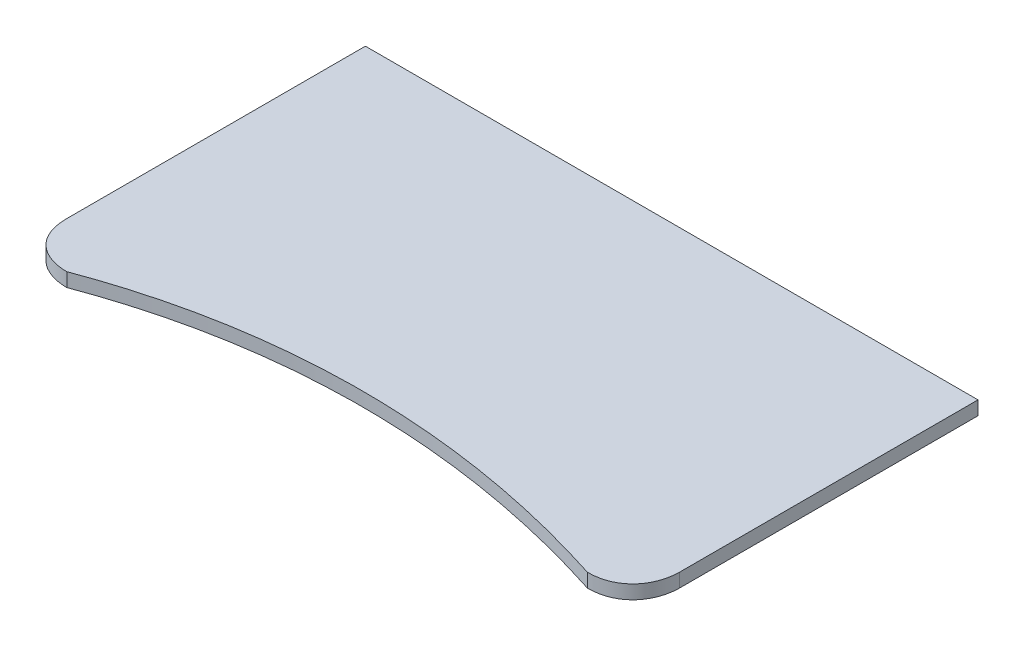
ISO-10303-21;
HEADER;
FILE_DESCRIPTION(('STEP AP214'),'2;1');
FILE_NAME('part.step','',(''),(''),'','','');
FILE_SCHEMA(('AUTOMOTIVE_DESIGN { 1 0 10303 214 1 1 1 1 }'));
ENDSEC;
DATA;
#1=APPLICATION_CONTEXT('core data for automotive mechanical design processes');
#2=APPLICATION_PROTOCOL_DEFINITION('international standard','automotive_design',2000,#1);
#3=PRODUCT_CONTEXT('',#1,'mechanical');
#4=PRODUCT('Part','Part','',(#3));
#5=PRODUCT_RELATED_PRODUCT_CATEGORY('part','',(#4));
#6=PRODUCT_DEFINITION_FORMATION('','',#4);
#7=PRODUCT_DEFINITION_CONTEXT('part definition',#1,'design');
#8=PRODUCT_DEFINITION('design','',#6,#7);
#9=PRODUCT_DEFINITION_SHAPE('','',#8);
#10=(LENGTH_UNIT() NAMED_UNIT(*) SI_UNIT(.MILLI.,.METRE.));
#11=(NAMED_UNIT(*) PLANE_ANGLE_UNIT() SI_UNIT($,.RADIAN.));
#12=(NAMED_UNIT(*) SI_UNIT($,.STERADIAN.) SOLID_ANGLE_UNIT());
#13=UNCERTAINTY_MEASURE_WITH_UNIT(LENGTH_MEASURE(1.E-05),#10,'distance_accuracy_value','');
#14=(GEOMETRIC_REPRESENTATION_CONTEXT(3) GLOBAL_UNCERTAINTY_ASSIGNED_CONTEXT((#13)) GLOBAL_UNIT_ASSIGNED_CONTEXT((#10,
#11,#12)) REPRESENTATION_CONTEXT('',''));
#15=CARTESIAN_POINT('',(0.,0.,0.));
#16=DIRECTION('',(0.,0.,1.));
#17=DIRECTION('',(1.,0.,0.));
#18=AXIS2_PLACEMENT_3D('',#15,#16,#17);
#19=CARTESIAN_POINT('',(-400.,18.,225.));
#20=DIRECTION('',(1.,0.,0.));
#21=DIRECTION('',(0.,0.,-1.));
#22=AXIS2_PLACEMENT_3D('',#19,#20,#21);
#23=PLANE('',#22);
#24=DIRECTION('',(0.,-1.,0.));
#25=VECTOR('',#24,1.);
#26=CARTESIAN_POINT('',(-400.,18.,165.));
#27=LINE('',#26,#25);
#28=CARTESIAN_POINT('',(-400.,18.,165.));
#29=VERTEX_POINT('',#28);
#30=CARTESIAN_POINT('',(-400.,0.,165.));
#31=VERTEX_POINT('',#30);
#32=EDGE_CURVE('E256',#29,#31,#27,.T.);
#33=ORIENTED_EDGE('',*,*,#32,.F.);
#34=DIRECTION('',(0.,0.,1.));
#35=VECTOR('',#34,1.);
#36=CARTESIAN_POINT('',(-400.,18.,225.));
#37=LINE('',#36,#35);
#38=CARTESIAN_POINT('',(-400.,18.,-225.));
#39=VERTEX_POINT('',#38);
#40=EDGE_CURVE('E290',#39,#29,#37,.T.);
#41=ORIENTED_EDGE('',*,*,#40,.F.);
#42=DIRECTION('',(0.,-1.,0.));
#43=VECTOR('',#42,1.);
#44=CARTESIAN_POINT('',(-400.,18.,-225.));
#45=LINE('',#44,#43);
#46=CARTESIAN_POINT('',(-400.,0.,-225.));
#47=VERTEX_POINT('',#46);
#48=EDGE_CURVE('E66',#39,#47,#45,.T.);
#49=ORIENTED_EDGE('',*,*,#48,.T.);
#50=DIRECTION('',(0.,0.,1.));
#51=VECTOR('',#50,1.);
#52=CARTESIAN_POINT('',(-400.,0.,225.));
#53=LINE('',#52,#51);
#54=EDGE_CURVE('E274',#47,#31,#53,.T.);
#55=ORIENTED_EDGE('',*,*,#54,.T.);
#56=EDGE_LOOP('',(#33,#41,#49,#55));
#57=FACE_BOUND('',#56,.T.);
#58=ADVANCED_FACE('F58',(#57),#23,.F.);
#59=CARTESIAN_POINT('',(0.,0.,0.));
#60=DIRECTION('',(0.,-1.,0.));
#61=DIRECTION('',(0.,0.,-1.));
#62=AXIS2_PLACEMENT_3D('',#59,#60,#61);
#63=PLANE('',#62);
#64=CARTESIAN_POINT('',(-400.,0.,165.));
#65=CARTESIAN_POINT('',(-400.,0.,207.944757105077));
#66=CARTESIAN_POINT('',(-368.79998722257,0.,225.));
#67=CARTESIAN_POINT('',(-340.,0.,225.));
#68=B_SPLINE_CURVE_WITH_KNOTS('',3,(#64,#65,#66,#67),.UNSPECIFIED.,.F.,.F.,(4,4),(0.,1.),.UNSPECIFIED.);
#69=CARTESIAN_POINT('',(-340.,0.,225.));
#70=VERTEX_POINT('',#69);
#71=EDGE_CURVE('E259',#31,#70,#68,.T.);
#72=ORIENTED_EDGE('',*,*,#71,.F.);
#73=ORIENTED_EDGE('',*,*,#54,.F.);
#74=DIRECTION('',(-1.,0.,0.));
#75=VECTOR('',#74,1.);
#76=CARTESIAN_POINT('',(-400.,0.,-225.));
#77=LINE('',#76,#75);
#78=CARTESIAN_POINT('',(400.,0.,-225.));
#79=VERTEX_POINT('',#78);
#80=EDGE_CURVE('E283',#79,#47,#77,.T.);
#81=ORIENTED_EDGE('',*,*,#80,.F.);
#82=DIRECTION('',(0.,0.,-1.));
#83=VECTOR('',#82,1.);
#84=CARTESIAN_POINT('',(400.,0.,225.));
#85=LINE('',#84,#83);
#86=CARTESIAN_POINT('',(400.,0.,165.));
#87=VERTEX_POINT('',#86);
#88=EDGE_CURVE('E287',#87,#79,#85,.T.);
#89=ORIENTED_EDGE('',*,*,#88,.F.);
#90=CARTESIAN_POINT('',(400.,0.,165.));
#91=CARTESIAN_POINT('',(400.,0.,192.903873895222));
#92=CARTESIAN_POINT('',(381.788949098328,0.,225.));
#93=CARTESIAN_POINT('',(340.,0.,225.));
#94=B_SPLINE_CURVE_WITH_KNOTS('',3,(#90,#91,#92,#93),.UNSPECIFIED.,.F.,.F.,(4,4),(0.,1.),.UNSPECIFIED.);
#95=CARTESIAN_POINT('',(340.,0.,225.));
#96=VERTEX_POINT('',#95);
#97=EDGE_CURVE('E278',#87,#96,#94,.T.);
#98=ORIENTED_EDGE('',*,*,#97,.T.);
#99=CARTESIAN_POINT('',(340.,0.,225.));
#100=CARTESIAN_POINT('',(89.5990960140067,0.,144.648306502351));
#101=CARTESIAN_POINT('',(-139.782326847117,0.,150.234927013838));
#102=CARTESIAN_POINT('',(-340.,0.,225.));
#103=B_SPLINE_CURVE_WITH_KNOTS('',3,(#99,#100,#101,#102),.UNSPECIFIED.,.F.,.F.,(4,4),(0.,1.),.UNSPECIFIED.);
#104=EDGE_CURVE('E277',#96,#70,#103,.T.);
#105=ORIENTED_EDGE('',*,*,#104,.T.);
#106=EDGE_LOOP('',(#72,#73,#81,#89,#98,#105));
#107=FACE_BOUND('',#106,.T.);
#108=DIRECTION('',(-1.,0.,0.));
#109=VECTOR('',#108,1.);
#110=CARTESIAN_POINT('',(-350.,0.,-160.));
#111=LINE('',#110,#109);
#112=CARTESIAN_POINT('',(-332.,0.,-160.));
#113=VERTEX_POINT('',#112);
#114=CARTESIAN_POINT('',(-350.,0.,-160.));
#115=VERTEX_POINT('',#114);
#116=EDGE_CURVE('E314',#113,#115,#111,.T.);
#117=ORIENTED_EDGE('',*,*,#116,.T.);
#118=DIRECTION('',(0.,0.,1.));
#119=VECTOR('',#118,1.);
#120=CARTESIAN_POINT('',(-350.,0.,-160.));
#121=LINE('',#120,#119);
#122=CARTESIAN_POINT('',(-350.,0.,-110.));
#123=VERTEX_POINT('',#122);
#124=EDGE_CURVE('E324',#115,#123,#121,.T.);
#125=ORIENTED_EDGE('',*,*,#124,.T.);
#126=DIRECTION('',(1.,0.,0.));
#127=VECTOR('',#126,1.);
#128=CARTESIAN_POINT('',(-350.,0.,-110.));
#129=LINE('',#128,#127);
#130=CARTESIAN_POINT('',(-332.,0.,-110.));
#131=VERTEX_POINT('',#130);
#132=EDGE_CURVE('E321',#123,#131,#129,.T.);
#133=ORIENTED_EDGE('',*,*,#132,.T.);
#134=DIRECTION('',(0.,0.,-1.));
#135=VECTOR('',#134,1.);
#136=CARTESIAN_POINT('',(-332.,0.,-160.));
#137=LINE('',#136,#135);
#138=EDGE_CURVE('E318',#131,#113,#137,.T.);
#139=ORIENTED_EDGE('',*,*,#138,.T.);
#140=EDGE_LOOP('',(#117,#125,#133,#139));
#141=FACE_BOUND('',#140,.T.);
#142=DIRECTION('',(1.,0.,0.));
#143=VECTOR('',#142,1.);
#144=CARTESIAN_POINT('',(350.,0.,-110.));
#145=LINE('',#144,#143);
#146=CARTESIAN_POINT('',(332.,0.,-110.));
#147=VERTEX_POINT('',#146);
#148=CARTESIAN_POINT('',(350.,0.,-110.));
#149=VERTEX_POINT('',#148);
#150=EDGE_CURVE('E345',#147,#149,#145,.T.);
#151=ORIENTED_EDGE('',*,*,#150,.T.);
#152=DIRECTION('',(0.,0.,-1.));
#153=VECTOR('',#152,1.);
#154=CARTESIAN_POINT('',(350.,0.,-160.));
#155=LINE('',#154,#153);
#156=CARTESIAN_POINT('',(350.,0.,-160.));
#157=VERTEX_POINT('',#156);
#158=EDGE_CURVE('E355',#149,#157,#155,.T.);
#159=ORIENTED_EDGE('',*,*,#158,.T.);
#160=DIRECTION('',(-1.,0.,0.));
#161=VECTOR('',#160,1.);
#162=CARTESIAN_POINT('',(350.,0.,-160.));
#163=LINE('',#162,#161);
#164=CARTESIAN_POINT('',(332.,0.,-160.));
#165=VERTEX_POINT('',#164);
#166=EDGE_CURVE('E352',#157,#165,#163,.T.);
#167=ORIENTED_EDGE('',*,*,#166,.T.);
#168=DIRECTION('',(0.,0.,1.));
#169=VECTOR('',#168,1.);
#170=CARTESIAN_POINT('',(332.,0.,-160.));
#171=LINE('',#170,#169);
#172=EDGE_CURVE('E349',#165,#147,#171,.T.);
#173=ORIENTED_EDGE('',*,*,#172,.T.);
#174=EDGE_LOOP('',(#151,#159,#167,#173));
#175=FACE_BOUND('',#174,.T.);
#176=DIRECTION('',(1.,0.,0.));
#177=VECTOR('',#176,1.);
#178=CARTESIAN_POINT('',(350.,0.,0.));
#179=LINE('',#178,#177);
#180=CARTESIAN_POINT('',(332.,0.,0.));
#181=VERTEX_POINT('',#180);
#182=CARTESIAN_POINT('',(350.,0.,0.));
#183=VERTEX_POINT('',#182);
#184=EDGE_CURVE('E378',#181,#183,#179,.T.);
#185=ORIENTED_EDGE('',*,*,#184,.T.);
#186=DIRECTION('',(0.,0.,-1.));
#187=VECTOR('',#186,1.);
#188=CARTESIAN_POINT('',(350.,0.,-50.));
#189=LINE('',#188,#187);
#190=CARTESIAN_POINT('',(350.,0.,-50.));
#191=VERTEX_POINT('',#190);
#192=EDGE_CURVE('E336',#183,#191,#189,.T.);
#193=ORIENTED_EDGE('',*,*,#192,.T.);
#194=DIRECTION('',(-1.,0.,0.));
#195=VECTOR('',#194,1.);
#196=CARTESIAN_POINT('',(350.,0.,-50.));
#197=LINE('',#196,#195);
#198=CARTESIAN_POINT('',(332.,0.,-50.));
#199=VERTEX_POINT('',#198);
#200=EDGE_CURVE('E385',#191,#199,#197,.T.);
#201=ORIENTED_EDGE('',*,*,#200,.T.);
#202=DIRECTION('',(0.,0.,1.));
#203=VECTOR('',#202,1.);
#204=CARTESIAN_POINT('',(332.,0.,-50.));
#205=LINE('',#204,#203);
#206=EDGE_CURVE('E382',#199,#181,#205,.T.);
#207=ORIENTED_EDGE('',*,*,#206,.T.);
#208=EDGE_LOOP('',(#185,#193,#201,#207));
#209=FACE_BOUND('',#208,.T.);
#210=DIRECTION('',(1.,0.,0.));
#211=VECTOR('',#210,1.);
#212=CARTESIAN_POINT('',(350.,0.,110.));
#213=LINE('',#212,#211);
#214=CARTESIAN_POINT('',(332.,0.,110.));
#215=VERTEX_POINT('',#214);
#216=CARTESIAN_POINT('',(350.,0.,110.));
#217=VERTEX_POINT('',#216);
#218=EDGE_CURVE('E409',#215,#217,#213,.T.);
#219=ORIENTED_EDGE('',*,*,#218,.T.);
#220=DIRECTION('',(0.,0.,-1.));
#221=VECTOR('',#220,1.);
#222=CARTESIAN_POINT('',(350.,0.,60.));
#223=LINE('',#222,#221);
#224=CARTESIAN_POINT('',(350.,0.,60.));
#225=VERTEX_POINT('',#224);
#226=EDGE_CURVE('E369',#217,#225,#223,.T.);
#227=ORIENTED_EDGE('',*,*,#226,.T.);
#228=DIRECTION('',(-1.,0.,0.));
#229=VECTOR('',#228,1.);
#230=CARTESIAN_POINT('',(350.,0.,60.));
#231=LINE('',#230,#229);
#232=CARTESIAN_POINT('',(332.,0.,60.));
#233=VERTEX_POINT('',#232);
#234=EDGE_CURVE('E416',#225,#233,#231,.T.);
#235=ORIENTED_EDGE('',*,*,#234,.T.);
#236=DIRECTION('',(0.,0.,1.));
#237=VECTOR('',#236,1.);
#238=CARTESIAN_POINT('',(332.,0.,60.));
#239=LINE('',#238,#237);
#240=EDGE_CURVE('E413',#233,#215,#239,.T.);
#241=ORIENTED_EDGE('',*,*,#240,.T.);
#242=EDGE_LOOP('',(#219,#227,#235,#241));
#243=FACE_BOUND('',#242,.T.);
#244=DIRECTION('',(-1.,0.,0.));
#245=VECTOR('',#244,1.);
#246=CARTESIAN_POINT('',(-350.,0.,60.));
#247=LINE('',#246,#245);
#248=CARTESIAN_POINT('',(-332.,0.,60.));
#249=VERTEX_POINT('',#248);
#250=CARTESIAN_POINT('',(-350.,0.,60.));
#251=VERTEX_POINT('',#250);
#252=EDGE_CURVE('E439',#249,#251,#247,.T.);
#253=ORIENTED_EDGE('',*,*,#252,.T.);
#254=DIRECTION('',(0.,0.,1.));
#255=VECTOR('',#254,1.);
#256=CARTESIAN_POINT('',(-350.,0.,60.));
#257=LINE('',#256,#255);
#258=CARTESIAN_POINT('',(-350.,0.,110.));
#259=VERTEX_POINT('',#258);
#260=EDGE_CURVE('E400',#251,#259,#257,.T.);
#261=ORIENTED_EDGE('',*,*,#260,.T.);
#262=DIRECTION('',(1.,0.,0.));
#263=VECTOR('',#262,1.);
#264=CARTESIAN_POINT('',(-350.,0.,110.));
#265=LINE('',#264,#263);
#266=CARTESIAN_POINT('',(-332.,0.,110.));
#267=VERTEX_POINT('',#266);
#268=EDGE_CURVE('E446',#259,#267,#265,.T.);
#269=ORIENTED_EDGE('',*,*,#268,.T.);
#270=DIRECTION('',(0.,0.,-1.));
#271=VECTOR('',#270,1.);
#272=CARTESIAN_POINT('',(-332.,0.,60.));
#273=LINE('',#272,#271);
#274=EDGE_CURVE('E443',#267,#249,#273,.T.);
#275=ORIENTED_EDGE('',*,*,#274,.T.);
#276=EDGE_LOOP('',(#253,#261,#269,#275));
#277=FACE_BOUND('',#276,.T.);
#278=DIRECTION('',(-1.,0.,0.));
#279=VECTOR('',#278,1.);
#280=CARTESIAN_POINT('',(-350.,0.,-50.));
#281=LINE('',#280,#279);
#282=CARTESIAN_POINT('',(-332.,0.,-50.));
#283=VERTEX_POINT('',#282);
#284=CARTESIAN_POINT('',(-350.,0.,-50.));
#285=VERTEX_POINT('',#284);
#286=EDGE_CURVE('E466',#283,#285,#281,.T.);
#287=ORIENTED_EDGE('',*,*,#286,.T.);
#288=DIRECTION('',(0.,0.,1.));
#289=VECTOR('',#288,1.);
#290=CARTESIAN_POINT('',(-350.,0.,-50.));
#291=LINE('',#290,#289);
#292=CARTESIAN_POINT('',(-350.,0.,0.));
#293=VERTEX_POINT('',#292);
#294=EDGE_CURVE('E81',#285,#293,#291,.T.);
#295=ORIENTED_EDGE('',*,*,#294,.T.);
#296=DIRECTION('',(1.,0.,0.));
#297=VECTOR('',#296,1.);
#298=CARTESIAN_POINT('',(-350.,0.,0.));
#299=LINE('',#298,#297);
#300=CARTESIAN_POINT('',(-332.,0.,0.));
#301=VERTEX_POINT('',#300);
#302=EDGE_CURVE('E473',#293,#301,#299,.T.);
#303=ORIENTED_EDGE('',*,*,#302,.T.);
#304=DIRECTION('',(0.,0.,-1.));
#305=VECTOR('',#304,1.);
#306=CARTESIAN_POINT('',(-332.,0.,-50.));
#307=LINE('',#306,#305);
#308=EDGE_CURVE('E470',#301,#283,#307,.T.);
#309=ORIENTED_EDGE('',*,*,#308,.T.);
#310=EDGE_LOOP('',(#287,#295,#303,#309));
#311=FACE_BOUND('',#310,.T.);
#312=ADVANCED_FACE('F271',(#107,#141,#175,#209,#243,#277,#311),#63,.T.);
#313=CARTESIAN_POINT('',(0.,18.,0.));
#314=DIRECTION('',(0.,-1.,0.));
#315=DIRECTION('',(0.,0.,-1.));
#316=AXIS2_PLACEMENT_3D('',#313,#314,#315);
#317=PLANE('',#316);
#318=ORIENTED_EDGE('',*,*,#40,.T.);
#319=CARTESIAN_POINT('',(-400.,18.,165.));
#320=CARTESIAN_POINT('',(-400.,18.,207.944757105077));
#321=CARTESIAN_POINT('',(-368.79998722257,18.,225.));
#322=CARTESIAN_POINT('',(-340.,18.,225.));
#323=B_SPLINE_CURVE_WITH_KNOTS('',3,(#319,#320,#321,#322),.UNSPECIFIED.,.F.,.F.,(4,4),(0.,1.),.UNSPECIFIED.);
#324=CARTESIAN_POINT('',(-340.,18.,225.));
#325=VERTEX_POINT('',#324);
#326=EDGE_CURVE('E262',#29,#325,#323,.T.);
#327=ORIENTED_EDGE('',*,*,#326,.T.);
#328=CARTESIAN_POINT('',(340.,18.,225.));
#329=CARTESIAN_POINT('',(89.5990960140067,18.,144.648306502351));
#330=CARTESIAN_POINT('',(-139.782326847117,18.,150.234927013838));
#331=CARTESIAN_POINT('',(-340.,18.,225.));
#332=B_SPLINE_CURVE_WITH_KNOTS('',3,(#328,#329,#330,#331),.UNSPECIFIED.,.F.,.F.,(4,4),(0.,1.),.UNSPECIFIED.);
#333=CARTESIAN_POINT('',(340.,18.,225.));
#334=VERTEX_POINT('',#333);
#335=EDGE_CURVE('E486',#334,#325,#332,.T.);
#336=ORIENTED_EDGE('',*,*,#335,.F.);
#337=CARTESIAN_POINT('',(400.,18.,165.));
#338=CARTESIAN_POINT('',(400.,18.,192.903873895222));
#339=CARTESIAN_POINT('',(381.788949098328,18.,225.));
#340=CARTESIAN_POINT('',(340.,18.,225.));
#341=B_SPLINE_CURVE_WITH_KNOTS('',3,(#337,#338,#339,#340),.UNSPECIFIED.,.F.,.F.,(4,4),(0.,1.),.UNSPECIFIED.);
#342=CARTESIAN_POINT('',(400.,18.,165.));
#343=VERTEX_POINT('',#342);
#344=EDGE_CURVE('E73',#343,#334,#341,.T.);
#345=ORIENTED_EDGE('',*,*,#344,.F.);
#346=DIRECTION('',(0.,0.,-1.));
#347=VECTOR('',#346,1.);
#348=CARTESIAN_POINT('',(400.,18.,225.));
#349=LINE('',#348,#347);
#350=CARTESIAN_POINT('',(400.,18.,-225.));
#351=VERTEX_POINT('',#350);
#352=EDGE_CURVE('E282',#343,#351,#349,.T.);
#353=ORIENTED_EDGE('',*,*,#352,.T.);
#354=DIRECTION('',(-1.,0.,0.));
#355=VECTOR('',#354,1.);
#356=CARTESIAN_POINT('',(-400.,18.,-225.));
#357=LINE('',#356,#355);
#358=EDGE_CURVE('E285',#351,#39,#357,.T.);
#359=ORIENTED_EDGE('',*,*,#358,.T.);
#360=EDGE_LOOP('',(#318,#327,#336,#345,#353,#359));
#361=FACE_BOUND('',#360,.T.);
#362=ADVANCED_FACE('F633',(#361),#317,.F.);
#363=CARTESIAN_POINT('',(400.,18.,225.));
#364=DIRECTION('',(-1.,0.,0.));
#365=DIRECTION('',(0.,0.,1.));
#366=AXIS2_PLACEMENT_3D('',#363,#364,#365);
#367=PLANE('',#366);
#368=ORIENTED_EDGE('',*,*,#352,.F.);
#369=DIRECTION('',(0.,-1.,0.));
#370=VECTOR('',#369,1.);
#371=CARTESIAN_POINT('',(400.,18.,165.));
#372=LINE('',#371,#370);
#373=EDGE_CURVE('E647',#343,#87,#372,.T.);
#374=ORIENTED_EDGE('',*,*,#373,.T.);
#375=ORIENTED_EDGE('',*,*,#88,.T.);
#376=DIRECTION('',(0.,-1.,0.));
#377=VECTOR('',#376,1.);
#378=CARTESIAN_POINT('',(400.,18.,-225.));
#379=LINE('',#378,#377);
#380=EDGE_CURVE('E12',#351,#79,#379,.T.);
#381=ORIENTED_EDGE('',*,*,#380,.F.);
#382=EDGE_LOOP('',(#368,#374,#375,#381));
#383=FACE_BOUND('',#382,.T.);
#384=ADVANCED_FACE('F60',(#383),#367,.F.);
#385=CARTESIAN_POINT('',(-400.,18.,-225.));
#386=DIRECTION('',(0.,0.,1.));
#387=DIRECTION('',(1.,0.,0.));
#388=AXIS2_PLACEMENT_3D('',#385,#386,#387);
#389=PLANE('',#388);
#390=ORIENTED_EDGE('',*,*,#80,.T.);
#391=ORIENTED_EDGE('',*,*,#48,.F.);
#392=ORIENTED_EDGE('',*,*,#358,.F.);
#393=ORIENTED_EDGE('',*,*,#380,.T.);
#394=EDGE_LOOP('',(#390,#391,#392,#393));
#395=FACE_BOUND('',#394,.T.);
#396=ADVANCED_FACE('F632',(#395),#389,.F.);
#397=CARTESIAN_POINT('',(-350.,13.,-160.));
#398=DIRECTION('',(1.,0.,0.));
#399=DIRECTION('',(0.,0.,-1.));
#400=AXIS2_PLACEMENT_3D('',#397,#398,#399);
#401=PLANE('',#400);
#402=ORIENTED_EDGE('',*,*,#124,.F.);
#403=DIRECTION('',(0.,-1.,0.));
#404=VECTOR('',#403,1.);
#405=CARTESIAN_POINT('',(-350.,13.,-160.));
#406=LINE('',#405,#404);
#407=CARTESIAN_POINT('',(-350.,13.,-160.));
#408=VERTEX_POINT('',#407);
#409=EDGE_CURVE('E310',#408,#115,#406,.T.);
#410=ORIENTED_EDGE('',*,*,#409,.F.);
#411=DIRECTION('',(0.,0.,1.));
#412=VECTOR('',#411,1.);
#413=CARTESIAN_POINT('',(-350.,13.,-160.));
#414=LINE('',#413,#412);
#415=CARTESIAN_POINT('',(-350.,13.,-110.));
#416=VERTEX_POINT('',#415);
#417=EDGE_CURVE('E317',#408,#416,#414,.T.);
#418=ORIENTED_EDGE('',*,*,#417,.T.);
#419=DIRECTION('',(0.,-1.,0.));
#420=VECTOR('',#419,1.);
#421=CARTESIAN_POINT('',(-350.,13.,-110.));
#422=LINE('',#421,#420);
#423=EDGE_CURVE('E294',#416,#123,#422,.T.);
#424=ORIENTED_EDGE('',*,*,#423,.T.);
#425=EDGE_LOOP('',(#402,#410,#418,#424));
#426=FACE_BOUND('',#425,.T.);
#427=ADVANCED_FACE('F628',(#426),#401,.T.);
#428=CARTESIAN_POINT('',(-350.,13.,-110.));
#429=DIRECTION('',(0.,0.,-1.));
#430=DIRECTION('',(-1.,0.,0.));
#431=AXIS2_PLACEMENT_3D('',#428,#429,#430);
#432=PLANE('',#431);
#433=ORIENTED_EDGE('',*,*,#132,.F.);
#434=ORIENTED_EDGE('',*,*,#423,.F.);
#435=DIRECTION('',(1.,0.,0.));
#436=VECTOR('',#435,1.);
#437=CARTESIAN_POINT('',(-350.,13.,-110.));
#438=LINE('',#437,#436);
#439=CARTESIAN_POINT('',(-332.,13.,-110.));
#440=VERTEX_POINT('',#439);
#441=EDGE_CURVE('E330',#416,#440,#438,.T.);
#442=ORIENTED_EDGE('',*,*,#441,.T.);
#443=DIRECTION('',(0.,-1.,0.));
#444=VECTOR('',#443,1.);
#445=CARTESIAN_POINT('',(-332.,13.,-110.));
#446=LINE('',#445,#444);
#447=EDGE_CURVE('E300',#440,#131,#446,.T.);
#448=ORIENTED_EDGE('',*,*,#447,.T.);
#449=EDGE_LOOP('',(#433,#434,#442,#448));
#450=FACE_BOUND('',#449,.T.);
#451=ADVANCED_FACE('F624',(#450),#432,.T.);
#452=CARTESIAN_POINT('',(-332.,13.,-160.));
#453=DIRECTION('',(-1.,0.,0.));
#454=DIRECTION('',(0.,0.,1.));
#455=AXIS2_PLACEMENT_3D('',#452,#453,#454);
#456=PLANE('',#455);
#457=ORIENTED_EDGE('',*,*,#138,.F.);
#458=ORIENTED_EDGE('',*,*,#447,.F.);
#459=DIRECTION('',(0.,0.,-1.));
#460=VECTOR('',#459,1.);
#461=CARTESIAN_POINT('',(-332.,13.,-160.));
#462=LINE('',#461,#460);
#463=CARTESIAN_POINT('',(-332.,13.,-160.));
#464=VERTEX_POINT('',#463);
#465=EDGE_CURVE('E328',#440,#464,#462,.T.);
#466=ORIENTED_EDGE('',*,*,#465,.T.);
#467=DIRECTION('',(0.,-1.,0.));
#468=VECTOR('',#467,1.);
#469=CARTESIAN_POINT('',(-332.,13.,-160.));
#470=LINE('',#469,#468);
#471=EDGE_CURVE('E306',#464,#113,#470,.T.);
#472=ORIENTED_EDGE('',*,*,#471,.T.);
#473=EDGE_LOOP('',(#457,#458,#466,#472));
#474=FACE_BOUND('',#473,.T.);
#475=ADVANCED_FACE('F620',(#474),#456,.T.);
#476=CARTESIAN_POINT('',(-350.,13.,-160.));
#477=DIRECTION('',(0.,0.,1.));
#478=DIRECTION('',(1.,0.,0.));
#479=AXIS2_PLACEMENT_3D('',#476,#477,#478);
#480=PLANE('',#479);
#481=ORIENTED_EDGE('',*,*,#116,.F.);
#482=ORIENTED_EDGE('',*,*,#471,.F.);
#483=DIRECTION('',(-1.,0.,0.));
#484=VECTOR('',#483,1.);
#485=CARTESIAN_POINT('',(-350.,13.,-160.));
#486=LINE('',#485,#484);
#487=EDGE_CURVE('E313',#464,#408,#486,.T.);
#488=ORIENTED_EDGE('',*,*,#487,.T.);
#489=ORIENTED_EDGE('',*,*,#409,.T.);
#490=EDGE_LOOP('',(#481,#482,#488,#489));
#491=FACE_BOUND('',#490,.T.);
#492=ADVANCED_FACE('F616',(#491),#480,.T.);
#493=CARTESIAN_POINT('',(0.,13.,0.));
#494=DIRECTION('',(0.,1.,0.));
#495=DIRECTION('',(0.,0.,1.));
#496=AXIS2_PLACEMENT_3D('',#493,#494,#495);
#497=PLANE('',#496);
#498=ORIENTED_EDGE('',*,*,#417,.F.);
#499=ORIENTED_EDGE('',*,*,#487,.F.);
#500=ORIENTED_EDGE('',*,*,#465,.F.);
#501=ORIENTED_EDGE('',*,*,#441,.F.);
#502=EDGE_LOOP('',(#498,#499,#500,#501));
#503=FACE_BOUND('',#502,.T.);
#504=ADVANCED_FACE('F612',(#503),#497,.F.);
#505=CARTESIAN_POINT('',(350.,13.,-160.));
#506=DIRECTION('',(-1.,0.,0.));
#507=DIRECTION('',(0.,0.,1.));
#508=AXIS2_PLACEMENT_3D('',#505,#506,#507);
#509=PLANE('',#508);
#510=ORIENTED_EDGE('',*,*,#158,.F.);
#511=DIRECTION('',(0.,-1.,0.));
#512=VECTOR('',#511,1.);
#513=CARTESIAN_POINT('',(350.,13.,-110.));
#514=LINE('',#513,#512);
#515=CARTESIAN_POINT('',(350.,13.,-110.));
#516=VERTEX_POINT('',#515);
#517=EDGE_CURVE('E341',#516,#149,#514,.T.);
#518=ORIENTED_EDGE('',*,*,#517,.F.);
#519=DIRECTION('',(0.,0.,-1.));
#520=VECTOR('',#519,1.);
#521=CARTESIAN_POINT('',(350.,13.,-160.));
#522=LINE('',#521,#520);
#523=CARTESIAN_POINT('',(350.,13.,-160.));
#524=VERTEX_POINT('',#523);
#525=EDGE_CURVE('E348',#516,#524,#522,.T.);
#526=ORIENTED_EDGE('',*,*,#525,.T.);
#527=DIRECTION('',(0.,-1.,0.));
#528=VECTOR('',#527,1.);
#529=CARTESIAN_POINT('',(350.,13.,-160.));
#530=LINE('',#529,#528);
#531=EDGE_CURVE('E333',#524,#157,#530,.T.);
#532=ORIENTED_EDGE('',*,*,#531,.T.);
#533=EDGE_LOOP('',(#510,#518,#526,#532));
#534=FACE_BOUND('',#533,.T.);
#535=ADVANCED_FACE('F608',(#534),#509,.T.);
#536=CARTESIAN_POINT('',(350.,13.,-160.));
#537=DIRECTION('',(0.,0.,1.));
#538=DIRECTION('',(1.,0.,0.));
#539=AXIS2_PLACEMENT_3D('',#536,#537,#538);
#540=PLANE('',#539);
#541=ORIENTED_EDGE('',*,*,#166,.F.);
#542=ORIENTED_EDGE('',*,*,#531,.F.);
#543=DIRECTION('',(-1.,0.,0.));
#544=VECTOR('',#543,1.);
#545=CARTESIAN_POINT('',(350.,13.,-160.));
#546=LINE('',#545,#544);
#547=CARTESIAN_POINT('',(332.,13.,-160.));
#548=VERTEX_POINT('',#547);
#549=EDGE_CURVE('E362',#524,#548,#546,.T.);
#550=ORIENTED_EDGE('',*,*,#549,.T.);
#551=DIRECTION('',(0.,-1.,0.));
#552=VECTOR('',#551,1.);
#553=CARTESIAN_POINT('',(332.,13.,-160.));
#554=LINE('',#553,#552);
#555=EDGE_CURVE('E337',#548,#165,#554,.T.);
#556=ORIENTED_EDGE('',*,*,#555,.T.);
#557=EDGE_LOOP('',(#541,#542,#550,#556));
#558=FACE_BOUND('',#557,.T.);
#559=ADVANCED_FACE('F604',(#558),#540,.T.);
#560=CARTESIAN_POINT('',(332.,13.,-160.));
#561=DIRECTION('',(1.,0.,0.));
#562=DIRECTION('',(0.,0.,-1.));
#563=AXIS2_PLACEMENT_3D('',#560,#561,#562);
#564=PLANE('',#563);
#565=ORIENTED_EDGE('',*,*,#172,.F.);
#566=ORIENTED_EDGE('',*,*,#555,.F.);
#567=DIRECTION('',(0.,0.,1.));
#568=VECTOR('',#567,1.);
#569=CARTESIAN_POINT('',(332.,13.,-160.));
#570=LINE('',#569,#568);
#571=CARTESIAN_POINT('',(332.,13.,-110.));
#572=VERTEX_POINT('',#571);
#573=EDGE_CURVE('E360',#548,#572,#570,.T.);
#574=ORIENTED_EDGE('',*,*,#573,.T.);
#575=DIRECTION('',(0.,-1.,0.));
#576=VECTOR('',#575,1.);
#577=CARTESIAN_POINT('',(332.,13.,-110.));
#578=LINE('',#577,#576);
#579=EDGE_CURVE('E339',#572,#147,#578,.T.);
#580=ORIENTED_EDGE('',*,*,#579,.T.);
#581=EDGE_LOOP('',(#565,#566,#574,#580));
#582=FACE_BOUND('',#581,.T.);
#583=ADVANCED_FACE('F600',(#582),#564,.T.);
#584=CARTESIAN_POINT('',(350.,13.,-110.));
#585=DIRECTION('',(0.,0.,-1.));
#586=DIRECTION('',(-1.,0.,0.));
#587=AXIS2_PLACEMENT_3D('',#584,#585,#586);
#588=PLANE('',#587);
#589=ORIENTED_EDGE('',*,*,#150,.F.);
#590=ORIENTED_EDGE('',*,*,#579,.F.);
#591=DIRECTION('',(1.,0.,0.));
#592=VECTOR('',#591,1.);
#593=CARTESIAN_POINT('',(350.,13.,-110.));
#594=LINE('',#593,#592);
#595=EDGE_CURVE('E344',#572,#516,#594,.T.);
#596=ORIENTED_EDGE('',*,*,#595,.T.);
#597=ORIENTED_EDGE('',*,*,#517,.T.);
#598=EDGE_LOOP('',(#589,#590,#596,#597));
#599=FACE_BOUND('',#598,.T.);
#600=ADVANCED_FACE('F596',(#599),#588,.T.);
#601=CARTESIAN_POINT('',(0.,13.,0.));
#602=DIRECTION('',(0.,-1.,0.));
#603=DIRECTION('',(0.,0.,-1.));
#604=AXIS2_PLACEMENT_3D('',#601,#602,#603);
#605=PLANE('',#604);
#606=ORIENTED_EDGE('',*,*,#525,.F.);
#607=ORIENTED_EDGE('',*,*,#595,.F.);
#608=ORIENTED_EDGE('',*,*,#573,.F.);
#609=ORIENTED_EDGE('',*,*,#549,.F.);
#610=EDGE_LOOP('',(#606,#607,#608,#609));
#611=FACE_BOUND('',#610,.T.);
#612=ADVANCED_FACE('F592',(#611),#605,.T.);
#613=CARTESIAN_POINT('',(350.,13.,-50.));
#614=DIRECTION('',(-1.,0.,0.));
#615=DIRECTION('',(0.,0.,1.));
#616=AXIS2_PLACEMENT_3D('',#613,#614,#615);
#617=PLANE('',#616);
#618=ORIENTED_EDGE('',*,*,#192,.F.);
#619=DIRECTION('',(0.,-1.,0.));
#620=VECTOR('',#619,1.);
#621=CARTESIAN_POINT('',(350.,13.,0.));
#622=LINE('',#621,#620);
#623=CARTESIAN_POINT('',(350.,13.,0.));
#624=VERTEX_POINT('',#623);
#625=EDGE_CURVE('E374',#624,#183,#622,.T.);
#626=ORIENTED_EDGE('',*,*,#625,.F.);
#627=DIRECTION('',(0.,0.,-1.));
#628=VECTOR('',#627,1.);
#629=CARTESIAN_POINT('',(350.,13.,-50.));
#630=LINE('',#629,#628);
#631=CARTESIAN_POINT('',(350.,13.,-50.));
#632=VERTEX_POINT('',#631);
#633=EDGE_CURVE('E381',#624,#632,#630,.T.);
#634=ORIENTED_EDGE('',*,*,#633,.T.);
#635=DIRECTION('',(0.,-1.,0.));
#636=VECTOR('',#635,1.);
#637=CARTESIAN_POINT('',(350.,13.,-50.));
#638=LINE('',#637,#636);
#639=EDGE_CURVE('E366',#632,#191,#638,.T.);
#640=ORIENTED_EDGE('',*,*,#639,.T.);
#641=EDGE_LOOP('',(#618,#626,#634,#640));
#642=FACE_BOUND('',#641,.T.);
#643=ADVANCED_FACE('F588',(#642),#617,.T.);
#644=CARTESIAN_POINT('',(350.,13.,-50.));
#645=DIRECTION('',(0.,0.,1.));
#646=DIRECTION('',(1.,0.,0.));
#647=AXIS2_PLACEMENT_3D('',#644,#645,#646);
#648=PLANE('',#647);
#649=ORIENTED_EDGE('',*,*,#200,.F.);
#650=ORIENTED_EDGE('',*,*,#639,.F.);
#651=DIRECTION('',(-1.,0.,0.));
#652=VECTOR('',#651,1.);
#653=CARTESIAN_POINT('',(350.,13.,-50.));
#654=LINE('',#653,#652);
#655=CARTESIAN_POINT('',(332.,13.,-50.));
#656=VERTEX_POINT('',#655);
#657=EDGE_CURVE('E393',#632,#656,#654,.T.);
#658=ORIENTED_EDGE('',*,*,#657,.T.);
#659=DIRECTION('',(0.,-1.,0.));
#660=VECTOR('',#659,1.);
#661=CARTESIAN_POINT('',(332.,13.,-50.));
#662=LINE('',#661,#660);
#663=EDGE_CURVE('E370',#656,#199,#662,.T.);
#664=ORIENTED_EDGE('',*,*,#663,.T.);
#665=EDGE_LOOP('',(#649,#650,#658,#664));
#666=FACE_BOUND('',#665,.T.);
#667=ADVANCED_FACE('F584',(#666),#648,.T.);
#668=CARTESIAN_POINT('',(332.,13.,-50.));
#669=DIRECTION('',(1.,0.,0.));
#670=DIRECTION('',(0.,0.,-1.));
#671=AXIS2_PLACEMENT_3D('',#668,#669,#670);
#672=PLANE('',#671);
#673=ORIENTED_EDGE('',*,*,#206,.F.);
#674=ORIENTED_EDGE('',*,*,#663,.F.);
#675=DIRECTION('',(0.,0.,1.));
#676=VECTOR('',#675,1.);
#677=CARTESIAN_POINT('',(332.,13.,-50.));
#678=LINE('',#677,#676);
#679=CARTESIAN_POINT('',(332.,13.,0.));
#680=VERTEX_POINT('',#679);
#681=EDGE_CURVE('E391',#656,#680,#678,.T.);
#682=ORIENTED_EDGE('',*,*,#681,.T.);
#683=DIRECTION('',(0.,-1.,0.));
#684=VECTOR('',#683,1.);
#685=CARTESIAN_POINT('',(332.,13.,0.));
#686=LINE('',#685,#684);
#687=EDGE_CURVE('E372',#680,#181,#686,.T.);
#688=ORIENTED_EDGE('',*,*,#687,.T.);
#689=EDGE_LOOP('',(#673,#674,#682,#688));
#690=FACE_BOUND('',#689,.T.);
#691=ADVANCED_FACE('F580',(#690),#672,.T.);
#692=CARTESIAN_POINT('',(350.,13.,0.));
#693=DIRECTION('',(0.,0.,-1.));
#694=DIRECTION('',(-1.,0.,0.));
#695=AXIS2_PLACEMENT_3D('',#692,#693,#694);
#696=PLANE('',#695);
#697=ORIENTED_EDGE('',*,*,#184,.F.);
#698=ORIENTED_EDGE('',*,*,#687,.F.);
#699=DIRECTION('',(1.,0.,0.));
#700=VECTOR('',#699,1.);
#701=CARTESIAN_POINT('',(350.,13.,0.));
#702=LINE('',#701,#700);
#703=EDGE_CURVE('E377',#680,#624,#702,.T.);
#704=ORIENTED_EDGE('',*,*,#703,.T.);
#705=ORIENTED_EDGE('',*,*,#625,.T.);
#706=EDGE_LOOP('',(#697,#698,#704,#705));
#707=FACE_BOUND('',#706,.T.);
#708=ADVANCED_FACE('F576',(#707),#696,.T.);
#709=CARTESIAN_POINT('',(0.,13.,0.));
#710=DIRECTION('',(0.,-1.,0.));
#711=DIRECTION('',(0.,0.,-1.));
#712=AXIS2_PLACEMENT_3D('',#709,#710,#711);
#713=PLANE('',#712);
#714=ORIENTED_EDGE('',*,*,#633,.F.);
#715=ORIENTED_EDGE('',*,*,#703,.F.);
#716=ORIENTED_EDGE('',*,*,#681,.F.);
#717=ORIENTED_EDGE('',*,*,#657,.F.);
#718=EDGE_LOOP('',(#714,#715,#716,#717));
#719=FACE_BOUND('',#718,.T.);
#720=ADVANCED_FACE('F572',(#719),#713,.T.);
#721=CARTESIAN_POINT('',(350.,13.,60.));
#722=DIRECTION('',(-1.,0.,0.));
#723=DIRECTION('',(0.,0.,1.));
#724=AXIS2_PLACEMENT_3D('',#721,#722,#723);
#725=PLANE('',#724);
#726=ORIENTED_EDGE('',*,*,#226,.F.);
#727=DIRECTION('',(0.,-1.,0.));
#728=VECTOR('',#727,1.);
#729=CARTESIAN_POINT('',(350.,13.,110.));
#730=LINE('',#729,#728);
#731=CARTESIAN_POINT('',(350.,13.,110.));
#732=VERTEX_POINT('',#731);
#733=EDGE_CURVE('E405',#732,#217,#730,.T.);
#734=ORIENTED_EDGE('',*,*,#733,.F.);
#735=DIRECTION('',(0.,0.,-1.));
#736=VECTOR('',#735,1.);
#737=CARTESIAN_POINT('',(350.,13.,60.));
#738=LINE('',#737,#736);
#739=CARTESIAN_POINT('',(350.,13.,60.));
#740=VERTEX_POINT('',#739);
#741=EDGE_CURVE('E412',#732,#740,#738,.T.);
#742=ORIENTED_EDGE('',*,*,#741,.T.);
#743=DIRECTION('',(0.,-1.,0.));
#744=VECTOR('',#743,1.);
#745=CARTESIAN_POINT('',(350.,13.,60.));
#746=LINE('',#745,#744);
#747=EDGE_CURVE('E397',#740,#225,#746,.T.);
#748=ORIENTED_EDGE('',*,*,#747,.T.);
#749=EDGE_LOOP('',(#726,#734,#742,#748));
#750=FACE_BOUND('',#749,.T.);
#751=ADVANCED_FACE('F568',(#750),#725,.T.);
#752=CARTESIAN_POINT('',(350.,13.,60.));
#753=DIRECTION('',(0.,0.,1.));
#754=DIRECTION('',(1.,0.,0.));
#755=AXIS2_PLACEMENT_3D('',#752,#753,#754);
#756=PLANE('',#755);
#757=ORIENTED_EDGE('',*,*,#234,.F.);
#758=ORIENTED_EDGE('',*,*,#747,.F.);
#759=DIRECTION('',(-1.,0.,0.));
#760=VECTOR('',#759,1.);
#761=CARTESIAN_POINT('',(350.,13.,60.));
#762=LINE('',#761,#760);
#763=CARTESIAN_POINT('',(332.,13.,60.));
#764=VERTEX_POINT('',#763);
#765=EDGE_CURVE('E424',#740,#764,#762,.T.);
#766=ORIENTED_EDGE('',*,*,#765,.T.);
#767=DIRECTION('',(0.,-1.,0.));
#768=VECTOR('',#767,1.);
#769=CARTESIAN_POINT('',(332.,13.,60.));
#770=LINE('',#769,#768);
#771=EDGE_CURVE('E401',#764,#233,#770,.T.);
#772=ORIENTED_EDGE('',*,*,#771,.T.);
#773=EDGE_LOOP('',(#757,#758,#766,#772));
#774=FACE_BOUND('',#773,.T.);
#775=ADVANCED_FACE('F564',(#774),#756,.T.);
#776=CARTESIAN_POINT('',(332.,13.,60.));
#777=DIRECTION('',(1.,0.,0.));
#778=DIRECTION('',(0.,0.,-1.));
#779=AXIS2_PLACEMENT_3D('',#776,#777,#778);
#780=PLANE('',#779);
#781=ORIENTED_EDGE('',*,*,#240,.F.);
#782=ORIENTED_EDGE('',*,*,#771,.F.);
#783=DIRECTION('',(0.,0.,1.));
#784=VECTOR('',#783,1.);
#785=CARTESIAN_POINT('',(332.,13.,60.));
#786=LINE('',#785,#784);
#787=CARTESIAN_POINT('',(332.,13.,110.));
#788=VERTEX_POINT('',#787);
#789=EDGE_CURVE('E422',#764,#788,#786,.T.);
#790=ORIENTED_EDGE('',*,*,#789,.T.);
#791=DIRECTION('',(0.,-1.,0.));
#792=VECTOR('',#791,1.);
#793=CARTESIAN_POINT('',(332.,13.,110.));
#794=LINE('',#793,#792);
#795=EDGE_CURVE('E403',#788,#215,#794,.T.);
#796=ORIENTED_EDGE('',*,*,#795,.T.);
#797=EDGE_LOOP('',(#781,#782,#790,#796));
#798=FACE_BOUND('',#797,.T.);
#799=ADVANCED_FACE('F560',(#798),#780,.T.);
#800=CARTESIAN_POINT('',(350.,13.,110.));
#801=DIRECTION('',(0.,0.,-1.));
#802=DIRECTION('',(-1.,0.,0.));
#803=AXIS2_PLACEMENT_3D('',#800,#801,#802);
#804=PLANE('',#803);
#805=ORIENTED_EDGE('',*,*,#218,.F.);
#806=ORIENTED_EDGE('',*,*,#795,.F.);
#807=DIRECTION('',(1.,0.,0.));
#808=VECTOR('',#807,1.);
#809=CARTESIAN_POINT('',(350.,13.,110.));
#810=LINE('',#809,#808);
#811=EDGE_CURVE('E408',#788,#732,#810,.T.);
#812=ORIENTED_EDGE('',*,*,#811,.T.);
#813=ORIENTED_EDGE('',*,*,#733,.T.);
#814=EDGE_LOOP('',(#805,#806,#812,#813));
#815=FACE_BOUND('',#814,.T.);
#816=ADVANCED_FACE('F556',(#815),#804,.T.);
#817=CARTESIAN_POINT('',(0.,13.,0.));
#818=DIRECTION('',(0.,-1.,0.));
#819=DIRECTION('',(0.,0.,-1.));
#820=AXIS2_PLACEMENT_3D('',#817,#818,#819);
#821=PLANE('',#820);
#822=ORIENTED_EDGE('',*,*,#741,.F.);
#823=ORIENTED_EDGE('',*,*,#811,.F.);
#824=ORIENTED_EDGE('',*,*,#789,.F.);
#825=ORIENTED_EDGE('',*,*,#765,.F.);
#826=EDGE_LOOP('',(#822,#823,#824,#825));
#827=FACE_BOUND('',#826,.T.);
#828=ADVANCED_FACE('F552',(#827),#821,.T.);
#829=CARTESIAN_POINT('',(-350.,13.,60.));
#830=DIRECTION('',(1.,0.,0.));
#831=DIRECTION('',(0.,0.,-1.));
#832=AXIS2_PLACEMENT_3D('',#829,#830,#831);
#833=PLANE('',#832);
#834=ORIENTED_EDGE('',*,*,#260,.F.);
#835=DIRECTION('',(0.,-1.,0.));
#836=VECTOR('',#835,1.);
#837=CARTESIAN_POINT('',(-350.,13.,60.));
#838=LINE('',#837,#836);
#839=CARTESIAN_POINT('',(-350.,13.,60.));
#840=VERTEX_POINT('',#839);
#841=EDGE_CURVE('E435',#840,#251,#838,.T.);
#842=ORIENTED_EDGE('',*,*,#841,.F.);
#843=DIRECTION('',(0.,0.,1.));
#844=VECTOR('',#843,1.);
#845=CARTESIAN_POINT('',(-350.,13.,60.));
#846=LINE('',#845,#844);
#847=CARTESIAN_POINT('',(-350.,13.,110.));
#848=VERTEX_POINT('',#847);
#849=EDGE_CURVE('E442',#840,#848,#846,.T.);
#850=ORIENTED_EDGE('',*,*,#849,.T.);
#851=DIRECTION('',(0.,-1.,0.));
#852=VECTOR('',#851,1.);
#853=CARTESIAN_POINT('',(-350.,13.,110.));
#854=LINE('',#853,#852);
#855=EDGE_CURVE('E428',#848,#259,#854,.T.);
#856=ORIENTED_EDGE('',*,*,#855,.T.);
#857=EDGE_LOOP('',(#834,#842,#850,#856));
#858=FACE_BOUND('',#857,.T.);
#859=ADVANCED_FACE('F548',(#858),#833,.T.);
#860=CARTESIAN_POINT('',(-350.,13.,110.));
#861=DIRECTION('',(0.,0.,-1.));
#862=DIRECTION('',(-1.,0.,0.));
#863=AXIS2_PLACEMENT_3D('',#860,#861,#862);
#864=PLANE('',#863);
#865=ORIENTED_EDGE('',*,*,#268,.F.);
#866=ORIENTED_EDGE('',*,*,#855,.F.);
#867=DIRECTION('',(1.,0.,0.));
#868=VECTOR('',#867,1.);
#869=CARTESIAN_POINT('',(-350.,13.,110.));
#870=LINE('',#869,#868);
#871=CARTESIAN_POINT('',(-332.,13.,110.));
#872=VERTEX_POINT('',#871);
#873=EDGE_CURVE('E454',#848,#872,#870,.T.);
#874=ORIENTED_EDGE('',*,*,#873,.T.);
#875=DIRECTION('',(0.,-1.,0.));
#876=VECTOR('',#875,1.);
#877=CARTESIAN_POINT('',(-332.,13.,110.));
#878=LINE('',#877,#876);
#879=EDGE_CURVE('E431',#872,#267,#878,.T.);
#880=ORIENTED_EDGE('',*,*,#879,.T.);
#881=EDGE_LOOP('',(#865,#866,#874,#880));
#882=FACE_BOUND('',#881,.T.);
#883=ADVANCED_FACE('F544',(#882),#864,.T.);
#884=CARTESIAN_POINT('',(-332.,13.,60.));
#885=DIRECTION('',(-1.,0.,0.));
#886=DIRECTION('',(0.,0.,1.));
#887=AXIS2_PLACEMENT_3D('',#884,#885,#886);
#888=PLANE('',#887);
#889=ORIENTED_EDGE('',*,*,#274,.F.);
#890=ORIENTED_EDGE('',*,*,#879,.F.);
#891=DIRECTION('',(0.,0.,-1.));
#892=VECTOR('',#891,1.);
#893=CARTESIAN_POINT('',(-332.,13.,60.));
#894=LINE('',#893,#892);
#895=CARTESIAN_POINT('',(-332.,13.,60.));
#896=VERTEX_POINT('',#895);
#897=EDGE_CURVE('E452',#872,#896,#894,.T.);
#898=ORIENTED_EDGE('',*,*,#897,.T.);
#899=DIRECTION('',(0.,-1.,0.));
#900=VECTOR('',#899,1.);
#901=CARTESIAN_POINT('',(-332.,13.,60.));
#902=LINE('',#901,#900);
#903=EDGE_CURVE('E433',#896,#249,#902,.T.);
#904=ORIENTED_EDGE('',*,*,#903,.T.);
#905=EDGE_LOOP('',(#889,#890,#898,#904));
#906=FACE_BOUND('',#905,.T.);
#907=ADVANCED_FACE('F540',(#906),#888,.T.);
#908=CARTESIAN_POINT('',(-350.,13.,60.));
#909=DIRECTION('',(0.,0.,1.));
#910=DIRECTION('',(1.,0.,0.));
#911=AXIS2_PLACEMENT_3D('',#908,#909,#910);
#912=PLANE('',#911);
#913=ORIENTED_EDGE('',*,*,#252,.F.);
#914=ORIENTED_EDGE('',*,*,#903,.F.);
#915=DIRECTION('',(-1.,0.,0.));
#916=VECTOR('',#915,1.);
#917=CARTESIAN_POINT('',(-350.,13.,60.));
#918=LINE('',#917,#916);
#919=EDGE_CURVE('E438',#896,#840,#918,.T.);
#920=ORIENTED_EDGE('',*,*,#919,.T.);
#921=ORIENTED_EDGE('',*,*,#841,.T.);
#922=EDGE_LOOP('',(#913,#914,#920,#921));
#923=FACE_BOUND('',#922,.T.);
#924=ADVANCED_FACE('F536',(#923),#912,.T.);
#925=CARTESIAN_POINT('',(0.,13.,0.));
#926=DIRECTION('',(0.,1.,0.));
#927=DIRECTION('',(0.,0.,1.));
#928=AXIS2_PLACEMENT_3D('',#925,#926,#927);
#929=PLANE('',#928);
#930=ORIENTED_EDGE('',*,*,#849,.F.);
#931=ORIENTED_EDGE('',*,*,#919,.F.);
#932=ORIENTED_EDGE('',*,*,#897,.F.);
#933=ORIENTED_EDGE('',*,*,#873,.F.);
#934=EDGE_LOOP('',(#930,#931,#932,#933));
#935=FACE_BOUND('',#934,.T.);
#936=ADVANCED_FACE('F533',(#935),#929,.F.);
#937=CARTESIAN_POINT('',(-350.,13.,-50.));
#938=DIRECTION('',(1.,0.,0.));
#939=DIRECTION('',(0.,0.,-1.));
#940=AXIS2_PLACEMENT_3D('',#937,#938,#939);
#941=PLANE('',#940);
#942=ORIENTED_EDGE('',*,*,#294,.F.);
#943=DIRECTION('',(0.,-1.,0.));
#944=VECTOR('',#943,1.);
#945=CARTESIAN_POINT('',(-350.,13.,-50.));
#946=LINE('',#945,#944);
#947=CARTESIAN_POINT('',(-350.,13.,-50.));
#948=VERTEX_POINT('',#947);
#949=EDGE_CURVE('E463',#948,#285,#946,.T.);
#950=ORIENTED_EDGE('',*,*,#949,.F.);
#951=DIRECTION('',(0.,0.,1.));
#952=VECTOR('',#951,1.);
#953=CARTESIAN_POINT('',(-350.,13.,-50.));
#954=LINE('',#953,#952);
#955=CARTESIAN_POINT('',(-350.,13.,0.));
#956=VERTEX_POINT('',#955);
#957=EDGE_CURVE('E469',#948,#956,#954,.T.);
#958=ORIENTED_EDGE('',*,*,#957,.T.);
#959=DIRECTION('',(0.,-1.,0.));
#960=VECTOR('',#959,1.);
#961=CARTESIAN_POINT('',(-350.,13.,0.));
#962=LINE('',#961,#960);
#963=EDGE_CURVE('E326',#956,#293,#962,.T.);
#964=ORIENTED_EDGE('',*,*,#963,.T.);
#965=EDGE_LOOP('',(#942,#950,#958,#964));
#966=FACE_BOUND('',#965,.T.);
#967=ADVANCED_FACE('F529',(#966),#941,.T.);
#968=CARTESIAN_POINT('',(-350.,13.,0.));
#969=DIRECTION('',(0.,0.,-1.));
#970=DIRECTION('',(-1.,0.,0.));
#971=AXIS2_PLACEMENT_3D('',#968,#969,#970);
#972=PLANE('',#971);
#973=ORIENTED_EDGE('',*,*,#302,.F.);
#974=ORIENTED_EDGE('',*,*,#963,.F.);
#975=DIRECTION('',(1.,0.,0.));
#976=VECTOR('',#975,1.);
#977=CARTESIAN_POINT('',(-350.,13.,0.));
#978=LINE('',#977,#976);
#979=CARTESIAN_POINT('',(-332.,13.,0.));
#980=VERTEX_POINT('',#979);
#981=EDGE_CURVE('E480',#956,#980,#978,.T.);
#982=ORIENTED_EDGE('',*,*,#981,.T.);
#983=DIRECTION('',(0.,-1.,0.));
#984=VECTOR('',#983,1.);
#985=CARTESIAN_POINT('',(-332.,13.,0.));
#986=LINE('',#985,#984);
#987=EDGE_CURVE('E459',#980,#301,#986,.T.);
#988=ORIENTED_EDGE('',*,*,#987,.T.);
#989=EDGE_LOOP('',(#973,#974,#982,#988));
#990=FACE_BOUND('',#989,.T.);
#991=ADVANCED_FACE('F525',(#990),#972,.T.);
#992=CARTESIAN_POINT('',(-332.,13.,-50.));
#993=DIRECTION('',(-1.,0.,0.));
#994=DIRECTION('',(0.,0.,1.));
#995=AXIS2_PLACEMENT_3D('',#992,#993,#994);
#996=PLANE('',#995);
#997=ORIENTED_EDGE('',*,*,#308,.F.);
#998=ORIENTED_EDGE('',*,*,#987,.F.);
#999=DIRECTION('',(0.,0.,-1.));
#1000=VECTOR('',#999,1.);
#1001=CARTESIAN_POINT('',(-332.,13.,-50.));
#1002=LINE('',#1001,#1000);
#1003=CARTESIAN_POINT('',(-332.,13.,-50.));
#1004=VERTEX_POINT('',#1003);
#1005=EDGE_CURVE('E478',#980,#1004,#1002,.T.);
#1006=ORIENTED_EDGE('',*,*,#1005,.T.);
#1007=DIRECTION('',(0.,-1.,0.));
#1008=VECTOR('',#1007,1.);
#1009=CARTESIAN_POINT('',(-332.,13.,-50.));
#1010=LINE('',#1009,#1008);
#1011=EDGE_CURVE('E461',#1004,#283,#1010,.T.);
#1012=ORIENTED_EDGE('',*,*,#1011,.T.);
#1013=EDGE_LOOP('',(#997,#998,#1006,#1012));
#1014=FACE_BOUND('',#1013,.T.);
#1015=ADVANCED_FACE('F521',(#1014),#996,.T.);
#1016=CARTESIAN_POINT('',(-350.,13.,-50.));
#1017=DIRECTION('',(0.,0.,1.));
#1018=DIRECTION('',(1.,0.,0.));
#1019=AXIS2_PLACEMENT_3D('',#1016,#1017,#1018);
#1020=PLANE('',#1019);
#1021=ORIENTED_EDGE('',*,*,#286,.F.);
#1022=ORIENTED_EDGE('',*,*,#1011,.F.);
#1023=DIRECTION('',(-1.,0.,0.));
#1024=VECTOR('',#1023,1.);
#1025=CARTESIAN_POINT('',(-350.,13.,-50.));
#1026=LINE('',#1025,#1024);
#1027=EDGE_CURVE('E465',#1004,#948,#1026,.T.);
#1028=ORIENTED_EDGE('',*,*,#1027,.T.);
#1029=ORIENTED_EDGE('',*,*,#949,.T.);
#1030=EDGE_LOOP('',(#1021,#1022,#1028,#1029));
#1031=FACE_BOUND('',#1030,.T.);
#1032=ADVANCED_FACE('F517',(#1031),#1020,.T.);
#1033=CARTESIAN_POINT('',(0.,13.,0.));
#1034=DIRECTION('',(0.,1.,0.));
#1035=DIRECTION('',(0.,0.,1.));
#1036=AXIS2_PLACEMENT_3D('',#1033,#1034,#1035);
#1037=PLANE('',#1036);
#1038=ORIENTED_EDGE('',*,*,#957,.F.);
#1039=ORIENTED_EDGE('',*,*,#1027,.F.);
#1040=ORIENTED_EDGE('',*,*,#1005,.F.);
#1041=ORIENTED_EDGE('',*,*,#981,.F.);
#1042=EDGE_LOOP('',(#1038,#1039,#1040,#1041));
#1043=FACE_BOUND('',#1042,.T.);
#1044=ADVANCED_FACE('F512',(#1043),#1037,.F.);
#1045=DIRECTION('',(0.,-1.,0.));
#1046=VECTOR('',#1045,1.);
#1047=SURFACE_OF_LINEAR_EXTRUSION('',#332,#1046);
#1048=ORIENTED_EDGE('',*,*,#104,.F.);
#1049=DIRECTION('',(0.,-1.,0.));
#1050=VECTOR('',#1049,1.);
#1051=CARTESIAN_POINT('',(340.,18.,225.));
#1052=LINE('',#1051,#1050);
#1053=EDGE_CURVE('E484',#334,#96,#1052,.T.);
#1054=ORIENTED_EDGE('',*,*,#1053,.F.);
#1055=ORIENTED_EDGE('',*,*,#335,.T.);
#1056=DIRECTION('',(0.,-1.,0.));
#1057=VECTOR('',#1056,1.);
#1058=CARTESIAN_POINT('',(-340.,18.,225.));
#1059=LINE('',#1058,#1057);
#1060=EDGE_CURVE('E358',#325,#70,#1059,.T.);
#1061=ORIENTED_EDGE('',*,*,#1060,.T.);
#1062=EDGE_LOOP('',(#1048,#1054,#1055,#1061));
#1063=FACE_BOUND('',#1062,.T.);
#1064=ADVANCED_FACE('F507',(#1063),#1047,.T.);
#1065=DIRECTION('',(0.,-1.,0.));
#1066=VECTOR('',#1065,1.);
#1067=SURFACE_OF_LINEAR_EXTRUSION('',#341,#1066);
#1068=ORIENTED_EDGE('',*,*,#97,.F.);
#1069=ORIENTED_EDGE('',*,*,#373,.F.);
#1070=ORIENTED_EDGE('',*,*,#344,.T.);
#1071=ORIENTED_EDGE('',*,*,#1053,.T.);
#1072=EDGE_LOOP('',(#1068,#1069,#1070,#1071));
#1073=FACE_BOUND('',#1072,.T.);
#1074=ADVANCED_FACE('F511',(#1073),#1067,.T.);
#1075=DIRECTION('',(0.,-1.,0.));
#1076=VECTOR('',#1075,1.);
#1077=SURFACE_OF_LINEAR_EXTRUSION('',#323,#1076);
#1078=ORIENTED_EDGE('',*,*,#71,.T.);
#1079=ORIENTED_EDGE('',*,*,#1060,.F.);
#1080=ORIENTED_EDGE('',*,*,#326,.F.);
#1081=ORIENTED_EDGE('',*,*,#32,.T.);
#1082=EDGE_LOOP('',(#1078,#1079,#1080,#1081));
#1083=FACE_BOUND('',#1082,.T.);
#1084=ADVANCED_FACE('F258',(#1083),#1077,.F.);
#1085=CLOSED_SHELL('',(#58,#312,#362,#384,#396,#427,#451,#475,#492,#504,#535,#559,#583,#600,
#612,#643,#667,#691,#708,#720,#751,#775,#799,#816,#828,#859,#883,#907,#924,#936,#967,#991,#1015,
#1032,#1044,#1064,#1074,#1084));
#1086=MANIFOLD_SOLID_BREP('B2',#1085);
#1087=ADVANCED_BREP_SHAPE_REPRESENTATION('',(#18,#1086),#14);
#1088=SHAPE_DEFINITION_REPRESENTATION(#9,#1087);
ENDSEC;
END-ISO-10303-21;
